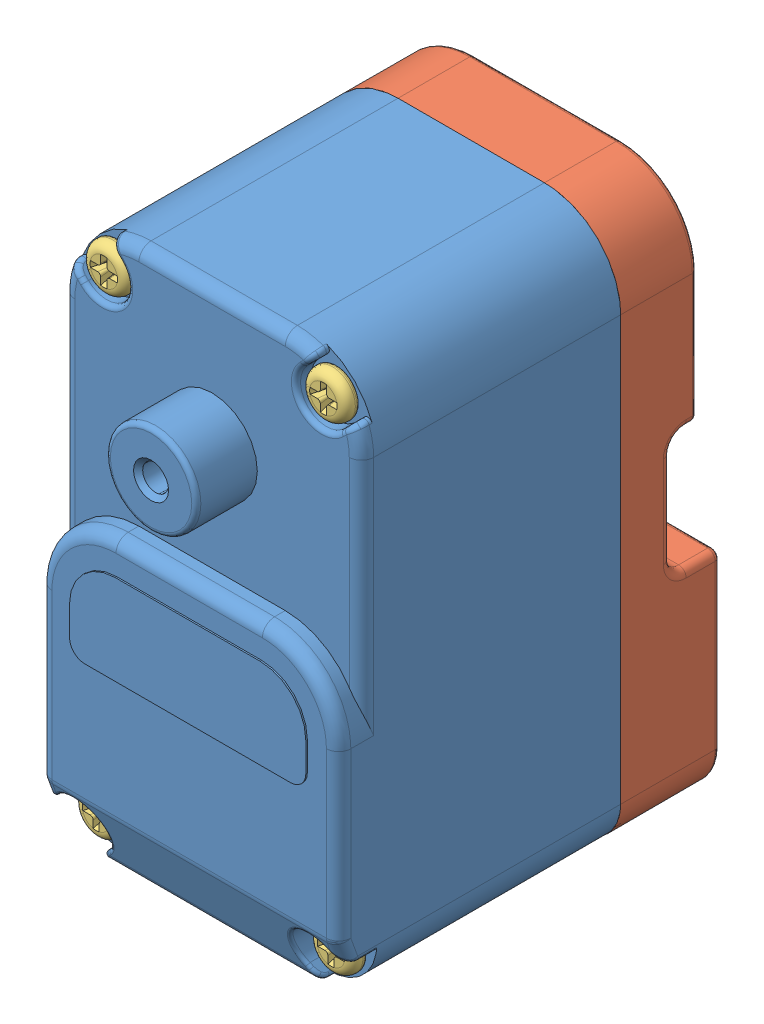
SolidWorks assembly RS318CD.SLDASM, configuration ﾃﾞﾌｫﾙﾄ (file format 10000). Lengths in mm.
Overall size (19.6 35.8 27.51).
6 component instances, 3 part files, 14 mates.
Components (placement in the parent):
- RS318CD-1: RS318CD.SLDPRT [ﾃﾞﾌｫﾙﾄ] at (-33.2 0 -5) size (19.6 35.8 25.5)
- RS318CD_BOTTOM CASE-1: RS318CD_BOTTOM CASE.SLDPRT [ﾃﾞﾌｫﾙﾄ] at (-33.2 0 -5) size (19.6 35.8 6.51)
- RS318CD_SCREW-1: RS318CD_SCREW.SLDPRT [ﾃﾞﾌｫﾙﾄ] at (-33.2 0 -5) size (3 3 20.9)
- RS318CD_SCREW-2: RS318CD_SCREW.SLDPRT [ﾃﾞﾌｫﾙﾄ] at (-47.6 0 -5) size (3 3 20.9)
- RS318CD_SCREW-3: RS318CD_SCREW.SLDPRT [ﾃﾞﾌｫﾙﾄ] at (-32.7 -31.1 -5) size (3 3 20.9)
- RS318CD_SCREW-4: RS318CD_SCREW.SLDPRT [ﾃﾞﾌｫﾙﾄ] at (-48.1 -31.1 -5) size (3 3 20.9)
Mates (geometry in assembly coordinates):
- Coincident1: coincident anti-aligned: plane of RS318CD-1 through (-12.2925 -11.4 -17.8) normal (-1 0 0); plane of RS318CD_BOTTOM CASE-1 through (-12.2925 -12.9 -17.8) normal (1 0 0)
- Coincident2: coincident anti-aligned: plane of RS318CD-1 through (1.6075 8.1 -17) normal (0 1 0); plane of RS318CD_BOTTOM CASE-1 through (-4.1925 8.1 -17.8) normal (0 -1 0)
- Coincident3: coincident anti-aligned: plane of RS318CD-1 through (-9.6879 -25.8345 -17) normal (0 0 -1); plane of RS318CD_BOTTOM CASE-1 through (4.3246 -23.7051 -17) normal (0 0 1)
- Concentric1: concentric aligned: cylinder of RS318CD-1 through (4.0075 6.2 -7.5) axis (0 0 1) radius 0.9; cylinder of RS318CD_SCREW-1 through (4.0075 6.2 -1) axis (0 0 1) radius 0.85
- Coincident4: coincident anti-aligned: plane of RS318CD-1 through (-3.1223 4.1391 -1) normal (0 0 1); plane of RS318CD_SCREW-1 through (27.9019 7.276 -1) normal (0 0 -1)
- Concentric2: concentric aligned: cylinder of RS318CD-1 through (-10.3925 6.2 -17.5) axis (0 0 1) radius 0.9; cylinder of RS318CD_SCREW-2 through (-10.3925 6.2 -1) axis (0 0 1) radius 0.85
- Coincident5: coincident anti-aligned: plane of RS318CD-1 through (-8.3316 -0.9298 -1) normal (0 0 1); plane of RS318CD_SCREW-2 through (13.5019 7.276 -1) normal (0 0 -1)
- Concentric3: concentric aligned: cylinder of RS318CD-1 through (4.5075 -24.9 -7.5) axis (0 0 1) radius 0.9; cylinder of RS318CD_SCREW-3 through (4.5075 -24.9 -1) axis (0 0 1) radius 0.85
- Coincident6: coincident anti-aligned: plane of RS318CD-1 through (-10.8925 -23.6979 -1) normal (0 0 1); plane of RS318CD_SCREW-3 through (28.4019 -23.824 -1) normal (0 0 -1)
- Concentric4: concentric aligned: cylinder of RS318CD-1 through (-10.8925 -24.9 -7.5) axis (0 0 1) radius 0.9; cylinder of RS318CD_SCREW-4 through (-10.8925 -24.9 -1) axis (0 0 1) radius 0.85
- Coincident7: coincident anti-aligned: plane of RS318CD-1 through (-10.8925 -23.6979 -1) normal (0 0 1); plane of RS318CD_SCREW-4 through (13.0019 -23.824 -1) normal (0 0 -1)
- Coincident8: coincident aligned: plane of RS318CD-1 through (1.3971 -12.4655 0) normal (0 0 1); plane of assembly through (0 0 0) normal (0 0 1)
- Distance1: distance = 8.8 mm aligned: plane of assembly through (0 0 0) normal (0 1 0); plane of RS318CD-1 through (4.8 8.8 -10.3) normal (0 1 0)
- Distance2: distance = 9.8 mm anti-aligned: plane of ? through (-9.8 -24 -7.5) normal (-1 0 0)
